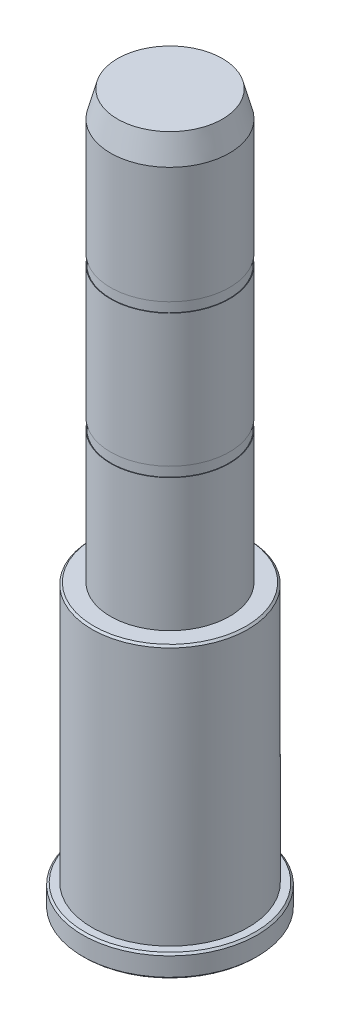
ISO-10303-21;
HEADER;
FILE_DESCRIPTION(('STEP AP214'),'2;1');
FILE_NAME('part.step','',(''),(''),'','','');
FILE_SCHEMA(('AUTOMOTIVE_DESIGN { 1 0 10303 214 1 1 1 1 }'));
ENDSEC;
DATA;
#1=APPLICATION_CONTEXT('core data for automotive mechanical design processes');
#2=APPLICATION_PROTOCOL_DEFINITION('international standard','automotive_design',2000,#1);
#3=PRODUCT_CONTEXT('',#1,'mechanical');
#4=PRODUCT('Part','Part','',(#3));
#5=PRODUCT_RELATED_PRODUCT_CATEGORY('part','',(#4));
#6=PRODUCT_DEFINITION_FORMATION('','',#4);
#7=PRODUCT_DEFINITION_CONTEXT('part definition',#1,'design');
#8=PRODUCT_DEFINITION('design','',#6,#7);
#9=PRODUCT_DEFINITION_SHAPE('','',#8);
#10=(LENGTH_UNIT() NAMED_UNIT(*) SI_UNIT(.MILLI.,.METRE.));
#11=(NAMED_UNIT(*) PLANE_ANGLE_UNIT() SI_UNIT($,.RADIAN.));
#12=(NAMED_UNIT(*) SI_UNIT($,.STERADIAN.) SOLID_ANGLE_UNIT());
#13=UNCERTAINTY_MEASURE_WITH_UNIT(LENGTH_MEASURE(1.E-05),#10,'distance_accuracy_value','');
#14=(GEOMETRIC_REPRESENTATION_CONTEXT(3) GLOBAL_UNCERTAINTY_ASSIGNED_CONTEXT((#13)) GLOBAL_UNIT_ASSIGNED_CONTEXT((#10,
#11,#12)) REPRESENTATION_CONTEXT('',''));
#15=CARTESIAN_POINT('',(0.,0.,0.));
#16=DIRECTION('',(0.,0.,1.));
#17=DIRECTION('',(1.,0.,0.));
#18=AXIS2_PLACEMENT_3D('',#15,#16,#17);
#19=CARTESIAN_POINT('',(-14.1243556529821,185.,0.));
#20=DIRECTION('',(0.,-1.,0.));
#21=DIRECTION('',(1.,0.,0.));
#22=AXIS2_PLACEMENT_3D('',#19,#20,#21);
#23=PLANE('',#22);
#24=CARTESIAN_POINT('',(0.,185.,0.));
#25=DIRECTION('',(0.,1.,0.));
#26=DIRECTION('',(-1.,0.,0.));
#27=AXIS2_PLACEMENT_3D('',#24,#25,#26);
#28=CIRCLE('',#27,14.1243556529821);
#29=CARTESIAN_POINT('',(-14.1243556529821,185.,0.));
#30=VERTEX_POINT('',#29);
#31=EDGE_CURVE('E50',#30,#30,#28,.T.);
#32=ORIENTED_EDGE('',*,*,#31,.T.);
#33=EDGE_LOOP('',(#32));
#34=FACE_BOUND('',#33,.T.);
#35=ADVANCED_FACE('F13',(#34),#23,.F.);
#36=CARTESIAN_POINT('',(0.,185.,0.));
#37=DIRECTION('',(0.,-1.,0.));
#38=DIRECTION('',(1.,0.,0.));
#39=AXIS2_PLACEMENT_3D('',#36,#37,#38);
#40=CONICAL_SURFACE('',#39,14.1243556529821,0.261799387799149);
#41=CARTESIAN_POINT('',(0.,178.,0.));
#42=DIRECTION('',(0.,1.,0.));
#43=DIRECTION('',(-1.,0.,0.));
#44=AXIS2_PLACEMENT_3D('',#41,#42,#43);
#45=CIRCLE('',#44,16.);
#46=CARTESIAN_POINT('',(-16.,178.,0.));
#47=VERTEX_POINT('',#46);
#48=EDGE_CURVE('E54',#47,#47,#45,.T.);
#49=ORIENTED_EDGE('',*,*,#48,.T.);
#50=EDGE_LOOP('',(#49));
#51=FACE_BOUND('',#50,.T.);
#52=ORIENTED_EDGE('',*,*,#31,.F.);
#53=EDGE_LOOP('',(#52));
#54=FACE_BOUND('',#53,.T.);
#55=ADVANCED_FACE('F112',(#51,#54),#40,.T.);
#56=CARTESIAN_POINT('',(0.,185.,0.));
#57=DIRECTION('',(0.,1.,0.));
#58=DIRECTION('',(-1.,0.,0.));
#59=AXIS2_PLACEMENT_3D('',#56,#57,#58);
#60=CYLINDRICAL_SURFACE('',#59,16.);
#61=ORIENTED_EDGE('',*,*,#48,.F.);
#62=EDGE_LOOP('',(#61));
#63=FACE_BOUND('',#62,.T.);
#64=CARTESIAN_POINT('',(0.,146.666666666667,0.));
#65=DIRECTION('',(0.,1.,0.));
#66=DIRECTION('',(-1.,0.,0.));
#67=AXIS2_PLACEMENT_3D('',#64,#65,#66);
#68=CIRCLE('',#67,16.);
#69=CARTESIAN_POINT('',(-16.,146.666666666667,0.));
#70=VERTEX_POINT('',#69);
#71=EDGE_CURVE('E58',#70,#70,#68,.T.);
#72=ORIENTED_EDGE('',*,*,#71,.T.);
#73=EDGE_LOOP('',(#72));
#74=FACE_BOUND('',#73,.T.);
#75=ADVANCED_FACE('F117',(#63,#74),#60,.T.);
#76=CARTESIAN_POINT('',(-15.85,146.666666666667,0.));
#77=DIRECTION('',(0.,1.,0.));
#78=DIRECTION('',(-1.,0.,0.));
#79=AXIS2_PLACEMENT_3D('',#76,#77,#78);
#80=PLANE('',#79);
#81=ORIENTED_EDGE('',*,*,#71,.F.);
#82=EDGE_LOOP('',(#81));
#83=FACE_BOUND('',#82,.T.);
#84=CARTESIAN_POINT('',(0.,146.666666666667,0.));
#85=DIRECTION('',(0.,1.,0.));
#86=DIRECTION('',(-1.,0.,0.));
#87=AXIS2_PLACEMENT_3D('',#84,#85,#86);
#88=CIRCLE('',#87,15.85);
#89=CARTESIAN_POINT('',(-15.85,146.666666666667,0.));
#90=VERTEX_POINT('',#89);
#91=EDGE_CURVE('E61',#90,#90,#88,.T.);
#92=ORIENTED_EDGE('',*,*,#91,.T.);
#93=EDGE_LOOP('',(#92));
#94=FACE_BOUND('',#93,.T.);
#95=ADVANCED_FACE('F262',(#83,#94),#80,.F.);
#96=CARTESIAN_POINT('',(0.,185.,0.));
#97=DIRECTION('',(0.,1.,0.));
#98=DIRECTION('',(-1.,0.,0.));
#99=AXIS2_PLACEMENT_3D('',#96,#97,#98);
#100=CYLINDRICAL_SURFACE('',#99,15.85);
#101=ORIENTED_EDGE('',*,*,#91,.F.);
#102=EDGE_LOOP('',(#101));
#103=FACE_BOUND('',#102,.T.);
#104=CARTESIAN_POINT('',(0.,144.,0.));
#105=DIRECTION('',(0.,1.,0.));
#106=DIRECTION('',(-1.,0.,0.));
#107=AXIS2_PLACEMENT_3D('',#104,#105,#106);
#108=CIRCLE('',#107,15.85);
#109=CARTESIAN_POINT('',(-15.85,144.,0.));
#110=VERTEX_POINT('',#109);
#111=EDGE_CURVE('E65',#110,#110,#108,.T.);
#112=ORIENTED_EDGE('',*,*,#111,.T.);
#113=EDGE_LOOP('',(#112));
#114=FACE_BOUND('',#113,.T.);
#115=ADVANCED_FACE('F252',(#103,#114),#100,.T.);
#116=CARTESIAN_POINT('',(-16.,144.,0.));
#117=DIRECTION('',(0.,-1.,0.));
#118=DIRECTION('',(1.,0.,0.));
#119=AXIS2_PLACEMENT_3D('',#116,#117,#118);
#120=PLANE('',#119);
#121=ORIENTED_EDGE('',*,*,#111,.F.);
#122=EDGE_LOOP('',(#121));
#123=FACE_BOUND('',#122,.T.);
#124=CARTESIAN_POINT('',(0.,144.,0.));
#125=DIRECTION('',(0.,1.,0.));
#126=DIRECTION('',(-1.,0.,0.));
#127=AXIS2_PLACEMENT_3D('',#124,#125,#126);
#128=CIRCLE('',#127,16.);
#129=CARTESIAN_POINT('',(-16.,144.,0.));
#130=VERTEX_POINT('',#129);
#131=EDGE_CURVE('E69',#130,#130,#128,.T.);
#132=ORIENTED_EDGE('',*,*,#131,.T.);
#133=EDGE_LOOP('',(#132));
#134=FACE_BOUND('',#133,.T.);
#135=ADVANCED_FACE('F242',(#123,#134),#120,.F.);
#136=CARTESIAN_POINT('',(0.,185.,0.));
#137=DIRECTION('',(0.,1.,0.));
#138=DIRECTION('',(-1.,0.,0.));
#139=AXIS2_PLACEMENT_3D('',#136,#137,#138);
#140=CYLINDRICAL_SURFACE('',#139,16.);
#141=ORIENTED_EDGE('',*,*,#131,.F.);
#142=EDGE_LOOP('',(#141));
#143=FACE_BOUND('',#142,.T.);
#144=CARTESIAN_POINT('',(0.,108.333333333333,0.));
#145=DIRECTION('',(0.,1.,0.));
#146=DIRECTION('',(-1.,0.,0.));
#147=AXIS2_PLACEMENT_3D('',#144,#145,#146);
#148=CIRCLE('',#147,16.);
#149=CARTESIAN_POINT('',(-16.,108.333333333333,0.));
#150=VERTEX_POINT('',#149);
#151=EDGE_CURVE('E72',#150,#150,#148,.T.);
#152=ORIENTED_EDGE('',*,*,#151,.T.);
#153=EDGE_LOOP('',(#152));
#154=FACE_BOUND('',#153,.T.);
#155=ADVANCED_FACE('F232',(#143,#154),#140,.T.);
#156=CARTESIAN_POINT('',(-15.85,108.333333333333,0.));
#157=DIRECTION('',(0.,1.,0.));
#158=DIRECTION('',(-1.,0.,0.));
#159=AXIS2_PLACEMENT_3D('',#156,#157,#158);
#160=PLANE('',#159);
#161=ORIENTED_EDGE('',*,*,#151,.F.);
#162=EDGE_LOOP('',(#161));
#163=FACE_BOUND('',#162,.T.);
#164=CARTESIAN_POINT('',(0.,108.333333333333,0.));
#165=DIRECTION('',(0.,1.,0.));
#166=DIRECTION('',(-1.,0.,0.));
#167=AXIS2_PLACEMENT_3D('',#164,#165,#166);
#168=CIRCLE('',#167,15.85);
#169=CARTESIAN_POINT('',(-15.85,108.333333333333,0.));
#170=VERTEX_POINT('',#169);
#171=EDGE_CURVE('E76',#170,#170,#168,.T.);
#172=ORIENTED_EDGE('',*,*,#171,.T.);
#173=EDGE_LOOP('',(#172));
#174=FACE_BOUND('',#173,.T.);
#175=ADVANCED_FACE('F222',(#163,#174),#160,.F.);
#176=CARTESIAN_POINT('',(0.,185.,0.));
#177=DIRECTION('',(0.,1.,0.));
#178=DIRECTION('',(-1.,0.,0.));
#179=AXIS2_PLACEMENT_3D('',#176,#177,#178);
#180=CYLINDRICAL_SURFACE('',#179,15.85);
#181=ORIENTED_EDGE('',*,*,#171,.F.);
#182=EDGE_LOOP('',(#181));
#183=FACE_BOUND('',#182,.T.);
#184=CARTESIAN_POINT('',(0.,105.666666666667,0.));
#185=DIRECTION('',(0.,1.,0.));
#186=DIRECTION('',(-1.,0.,0.));
#187=AXIS2_PLACEMENT_3D('',#184,#185,#186);
#188=CIRCLE('',#187,15.85);
#189=CARTESIAN_POINT('',(-15.85,105.666666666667,0.));
#190=VERTEX_POINT('',#189);
#191=EDGE_CURVE('E80',#190,#190,#188,.T.);
#192=ORIENTED_EDGE('',*,*,#191,.T.);
#193=EDGE_LOOP('',(#192));
#194=FACE_BOUND('',#193,.T.);
#195=ADVANCED_FACE('F212',(#183,#194),#180,.T.);
#196=CARTESIAN_POINT('',(-16.,105.666666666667,0.));
#197=DIRECTION('',(0.,-1.,0.));
#198=DIRECTION('',(1.,0.,0.));
#199=AXIS2_PLACEMENT_3D('',#196,#197,#198);
#200=PLANE('',#199);
#201=ORIENTED_EDGE('',*,*,#191,.F.);
#202=EDGE_LOOP('',(#201));
#203=FACE_BOUND('',#202,.T.);
#204=CARTESIAN_POINT('',(0.,105.666666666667,0.));
#205=DIRECTION('',(0.,1.,0.));
#206=DIRECTION('',(-1.,0.,0.));
#207=AXIS2_PLACEMENT_3D('',#204,#205,#206);
#208=CIRCLE('',#207,16.);
#209=CARTESIAN_POINT('',(-16.,105.666666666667,0.));
#210=VERTEX_POINT('',#209);
#211=EDGE_CURVE('E84',#210,#210,#208,.T.);
#212=ORIENTED_EDGE('',*,*,#211,.T.);
#213=EDGE_LOOP('',(#212));
#214=FACE_BOUND('',#213,.T.);
#215=ADVANCED_FACE('F202',(#203,#214),#200,.F.);
#216=CARTESIAN_POINT('',(0.,185.,0.));
#217=DIRECTION('',(0.,1.,0.));
#218=DIRECTION('',(-1.,0.,0.));
#219=AXIS2_PLACEMENT_3D('',#216,#217,#218);
#220=CYLINDRICAL_SURFACE('',#219,16.);
#221=ORIENTED_EDGE('',*,*,#211,.F.);
#222=EDGE_LOOP('',(#221));
#223=FACE_BOUND('',#222,.T.);
#224=CARTESIAN_POINT('',(0.,70.,0.));
#225=DIRECTION('',(0.,1.,0.));
#226=DIRECTION('',(-1.,0.,0.));
#227=AXIS2_PLACEMENT_3D('',#224,#225,#226);
#228=CIRCLE('',#227,16.);
#229=CARTESIAN_POINT('',(-16.,70.,0.));
#230=VERTEX_POINT('',#229);
#231=EDGE_CURVE('E88',#230,#230,#228,.T.);
#232=ORIENTED_EDGE('',*,*,#231,.T.);
#233=EDGE_LOOP('',(#232));
#234=FACE_BOUND('',#233,.T.);
#235=ADVANCED_FACE('F192',(#223,#234),#220,.T.);
#236=CARTESIAN_POINT('',(-21.,70.,0.));
#237=DIRECTION('',(0.,-1.,0.));
#238=DIRECTION('',(1.,0.,0.));
#239=AXIS2_PLACEMENT_3D('',#236,#237,#238);
#240=PLANE('',#239);
#241=CARTESIAN_POINT('',(0.,70.,0.));
#242=DIRECTION('',(0.,-1.,0.));
#243=DIRECTION('',(1.,0.,0.));
#244=AXIS2_PLACEMENT_3D('',#241,#242,#243);
#245=CIRCLE('',#244,20.5);
#246=CARTESIAN_POINT('',(20.5,70.,0.));
#247=VERTEX_POINT('',#246);
#248=EDGE_CURVE('E46',#247,#247,#245,.F.);
#249=ORIENTED_EDGE('',*,*,#248,.T.);
#250=EDGE_LOOP('',(#249));
#251=FACE_BOUND('',#250,.T.);
#252=ORIENTED_EDGE('',*,*,#231,.F.);
#253=EDGE_LOOP('',(#252));
#254=FACE_BOUND('',#253,.T.);
#255=ADVANCED_FACE('F108',(#251,#254),#240,.F.);
#256=CARTESIAN_POINT('',(0.,185.,0.));
#257=DIRECTION('',(0.,1.,0.));
#258=DIRECTION('',(-1.,0.,0.));
#259=AXIS2_PLACEMENT_3D('',#256,#257,#258);
#260=CYLINDRICAL_SURFACE('',#259,21.);
#261=CARTESIAN_POINT('',(0.,69.5,0.));
#262=DIRECTION('',(0.,-1.,0.));
#263=DIRECTION('',(1.,0.,0.));
#264=AXIS2_PLACEMENT_3D('',#261,#262,#263);
#265=CIRCLE('',#264,21.);
#266=CARTESIAN_POINT('',(21.,69.5,0.));
#267=VERTEX_POINT('',#266);
#268=EDGE_CURVE('E42',#267,#267,#265,.T.);
#269=ORIENTED_EDGE('',*,*,#268,.T.);
#270=EDGE_LOOP('',(#269));
#271=FACE_BOUND('',#270,.T.);
#272=CARTESIAN_POINT('',(0.,0.,0.));
#273=DIRECTION('',(0.,1.,0.));
#274=DIRECTION('',(-1.,0.,0.));
#275=AXIS2_PLACEMENT_3D('',#272,#273,#274);
#276=CIRCLE('',#275,21.);
#277=CARTESIAN_POINT('',(-21.,0.,0.));
#278=VERTEX_POINT('',#277);
#279=EDGE_CURVE('E91',#278,#278,#276,.T.);
#280=ORIENTED_EDGE('',*,*,#279,.T.);
#281=EDGE_LOOP('',(#280));
#282=FACE_BOUND('',#281,.T.);
#283=ADVANCED_FACE('F95',(#271,#282),#260,.T.);
#284=CARTESIAN_POINT('',(-23.5,0.,0.));
#285=DIRECTION('',(0.,-1.,0.));
#286=DIRECTION('',(1.,0.,0.));
#287=AXIS2_PLACEMENT_3D('',#284,#285,#286);
#288=PLANE('',#287);
#289=CARTESIAN_POINT('',(0.,0.,0.));
#290=DIRECTION('',(0.,-1.,0.));
#291=DIRECTION('',(1.,0.,0.));
#292=AXIS2_PLACEMENT_3D('',#289,#290,#291);
#293=CIRCLE('',#292,23.);
#294=CARTESIAN_POINT('',(23.,0.,0.));
#295=VERTEX_POINT('',#294);
#296=EDGE_CURVE('E36',#295,#295,#293,.F.);
#297=ORIENTED_EDGE('',*,*,#296,.T.);
#298=EDGE_LOOP('',(#297));
#299=FACE_BOUND('',#298,.T.);
#300=ORIENTED_EDGE('',*,*,#279,.F.);
#301=EDGE_LOOP('',(#300));
#302=FACE_BOUND('',#301,.T.);
#303=ADVANCED_FACE('F97',(#299,#302),#288,.F.);
#304=CARTESIAN_POINT('',(0.,185.,0.));
#305=DIRECTION('',(0.,1.,0.));
#306=DIRECTION('',(-1.,0.,0.));
#307=AXIS2_PLACEMENT_3D('',#304,#305,#306);
#308=CYLINDRICAL_SURFACE('',#307,23.5);
#309=CARTESIAN_POINT('',(0.,-0.499999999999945,0.));
#310=DIRECTION('',(0.,-1.,0.));
#311=DIRECTION('',(1.,0.,0.));
#312=AXIS2_PLACEMENT_3D('',#309,#310,#311);
#313=CIRCLE('',#312,23.5);
#314=CARTESIAN_POINT('',(23.5,-0.499999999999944,0.));
#315=VERTEX_POINT('',#314);
#316=EDGE_CURVE('E21',#315,#315,#313,.T.);
#317=ORIENTED_EDGE('',*,*,#316,.T.);
#318=EDGE_LOOP('',(#317));
#319=FACE_BOUND('',#318,.T.);
#320=CARTESIAN_POINT('',(0.,-5.5,0.));
#321=DIRECTION('',(0.,1.,0.));
#322=DIRECTION('',(-1.,0.,0.));
#323=AXIS2_PLACEMENT_3D('',#320,#321,#322);
#324=CIRCLE('',#323,23.5);
#325=CARTESIAN_POINT('',(-23.5,-5.5,0.));
#326=VERTEX_POINT('',#325);
#327=EDGE_CURVE('E29',#326,#326,#324,.T.);
#328=ORIENTED_EDGE('',*,*,#327,.T.);
#329=EDGE_LOOP('',(#328));
#330=FACE_BOUND('',#329,.T.);
#331=ADVANCED_FACE('F99',(#319,#330),#308,.T.);
#332=CARTESIAN_POINT('',(0.,-6.,0.));
#333=DIRECTION('',(0.,1.,0.));
#334=DIRECTION('',(-1.,0.,0.));
#335=AXIS2_PLACEMENT_3D('',#332,#333,#334);
#336=PLANE('',#335);
#337=CARTESIAN_POINT('',(0.,-6.,0.));
#338=DIRECTION('',(0.,1.,0.));
#339=DIRECTION('',(-1.,0.,0.));
#340=AXIS2_PLACEMENT_3D('',#337,#338,#339);
#341=CIRCLE('',#340,23.);
#342=CARTESIAN_POINT('',(-23.,-6.,0.));
#343=VERTEX_POINT('',#342);
#344=EDGE_CURVE('E8',#343,#343,#341,.F.);
#345=ORIENTED_EDGE('',*,*,#344,.T.);
#346=EDGE_LOOP('',(#345));
#347=FACE_BOUND('',#346,.T.);
#348=ADVANCED_FACE('F106',(#347),#336,.F.);
#349=CARTESIAN_POINT('',(0.,70.,0.));
#350=DIRECTION('',(0.,-1.,0.));
#351=DIRECTION('',(1.,0.,0.));
#352=AXIS2_PLACEMENT_3D('',#349,#350,#351);
#353=CONICAL_SURFACE('',#352,20.5,0.785398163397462);
#354=ORIENTED_EDGE('',*,*,#268,.F.);
#355=EDGE_LOOP('',(#354));
#356=FACE_BOUND('',#355,.T.);
#357=ORIENTED_EDGE('',*,*,#248,.F.);
#358=EDGE_LOOP('',(#357));
#359=FACE_BOUND('',#358,.T.);
#360=ADVANCED_FACE('F122',(#356,#359),#353,.T.);
#361=CARTESIAN_POINT('',(0.,0.,0.));
#362=DIRECTION('',(0.,-1.,0.));
#363=DIRECTION('',(1.,0.,0.));
#364=AXIS2_PLACEMENT_3D('',#361,#362,#363);
#365=CONICAL_SURFACE('',#364,23.,0.785398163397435);
#366=ORIENTED_EDGE('',*,*,#316,.F.);
#367=EDGE_LOOP('',(#366));
#368=FACE_BOUND('',#367,.T.);
#369=ORIENTED_EDGE('',*,*,#296,.F.);
#370=EDGE_LOOP('',(#369));
#371=FACE_BOUND('',#370,.T.);
#372=ADVANCED_FACE('F124',(#368,#371),#365,.T.);
#373=CARTESIAN_POINT('',(0.,-5.5,0.));
#374=DIRECTION('',(0.,1.,0.));
#375=DIRECTION('',(-1.,0.,0.));
#376=AXIS2_PLACEMENT_3D('',#373,#374,#375);
#377=CONICAL_SURFACE('',#376,23.5,0.785398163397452);
#378=ORIENTED_EDGE('',*,*,#344,.F.);
#379=EDGE_LOOP('',(#378));
#380=FACE_BOUND('',#379,.T.);
#381=ORIENTED_EDGE('',*,*,#327,.F.);
#382=EDGE_LOOP('',(#381));
#383=FACE_BOUND('',#382,.T.);
#384=ADVANCED_FACE('F15',(#380,#383),#377,.T.);
#385=CLOSED_SHELL('',(#35,#55,#75,#95,#115,#135,#155,#175,#195,#215,#235,#255,#283,#303,#331,
#348,#360,#372,#384));
#386=MANIFOLD_SOLID_BREP('B1',#385);
#387=ADVANCED_BREP_SHAPE_REPRESENTATION('',(#18,#386),#14);
#388=SHAPE_DEFINITION_REPRESENTATION(#9,#387);
ENDSEC;
END-ISO-10303-21;
